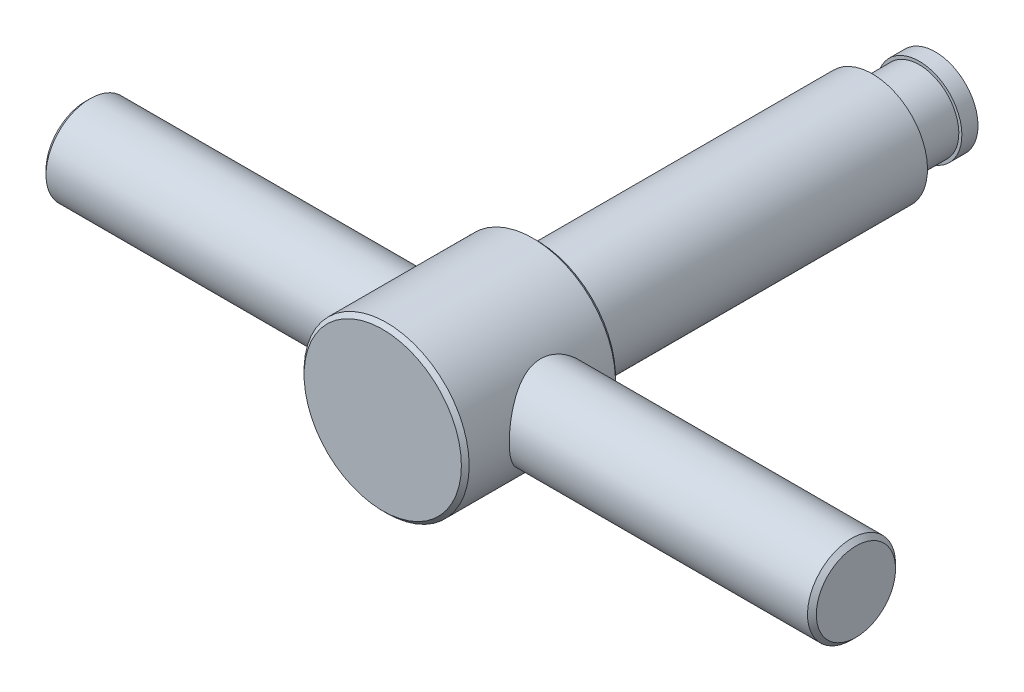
ISO-10303-21;
HEADER;
FILE_DESCRIPTION(('STEP AP214'),'2;1');
FILE_NAME('part.step','',(''),(''),'','','');
FILE_SCHEMA(('AUTOMOTIVE_DESIGN { 1 0 10303 214 1 1 1 1 }'));
ENDSEC;
DATA;
#1=APPLICATION_CONTEXT('core data for automotive mechanical design processes');
#2=APPLICATION_PROTOCOL_DEFINITION('international standard','automotive_design',2000,#1);
#3=PRODUCT_CONTEXT('',#1,'mechanical');
#4=PRODUCT('Part','Part','',(#3));
#5=PRODUCT_RELATED_PRODUCT_CATEGORY('part','',(#4));
#6=PRODUCT_DEFINITION_FORMATION('','',#4);
#7=PRODUCT_DEFINITION_CONTEXT('part definition',#1,'design');
#8=PRODUCT_DEFINITION('design','',#6,#7);
#9=PRODUCT_DEFINITION_SHAPE('','',#8);
#10=(LENGTH_UNIT() NAMED_UNIT(*) SI_UNIT(.MILLI.,.METRE.));
#11=(NAMED_UNIT(*) PLANE_ANGLE_UNIT() SI_UNIT($,.RADIAN.));
#12=(NAMED_UNIT(*) SI_UNIT($,.STERADIAN.) SOLID_ANGLE_UNIT());
#13=UNCERTAINTY_MEASURE_WITH_UNIT(LENGTH_MEASURE(1.E-05),#10,'distance_accuracy_value','');
#14=(GEOMETRIC_REPRESENTATION_CONTEXT(3) GLOBAL_UNCERTAINTY_ASSIGNED_CONTEXT((#13)) GLOBAL_UNIT_ASSIGNED_CONTEXT((#10,
#11,#12)) REPRESENTATION_CONTEXT('',''));
#15=CARTESIAN_POINT('',(0.,0.,0.));
#16=DIRECTION('',(0.,0.,1.));
#17=DIRECTION('',(1.,0.,0.));
#18=AXIS2_PLACEMENT_3D('',#15,#16,#17);
#19=CARTESIAN_POINT('',(70.,0.,94.2));
#20=DIRECTION('',(-1.,0.,0.));
#21=DIRECTION('',(0.,-1.,0.));
#22=AXIS2_PLACEMENT_3D('',#19,#20,#21);
#23=PLANE('',#22);
#24=CARTESIAN_POINT('',(70.,0.,87.));
#25=DIRECTION('',(-1.,0.,0.));
#26=DIRECTION('',(0.,-1.,0.));
#27=AXIS2_PLACEMENT_3D('',#24,#25,#26);
#28=CIRCLE('',#27,7.2);
#29=CARTESIAN_POINT('',(70.,-7.2,87.));
#30=VERTEX_POINT('',#29);
#31=EDGE_CURVE('E15',#30,#30,#28,.T.);
#32=ORIENTED_EDGE('',*,*,#31,.F.);
#33=EDGE_LOOP('',(#32));
#34=FACE_BOUND('',#33,.T.);
#35=ADVANCED_FACE('F12',(#34),#23,.F.);
#36=CARTESIAN_POINT('',(-70.,0.,87.));
#37=DIRECTION('',(1.,0.,0.));
#38=DIRECTION('',(0.,1.,0.));
#39=AXIS2_PLACEMENT_3D('',#36,#37,#38);
#40=PLANE('',#39);
#41=CARTESIAN_POINT('',(-70.,0.,87.));
#42=DIRECTION('',(1.,0.,0.));
#43=DIRECTION('',(0.,1.,0.));
#44=AXIS2_PLACEMENT_3D('',#41,#42,#43);
#45=CIRCLE('',#44,7.2);
#46=CARTESIAN_POINT('',(-70.,7.2,87.));
#47=VERTEX_POINT('',#46);
#48=EDGE_CURVE('E133',#47,#47,#45,.T.);
#49=ORIENTED_EDGE('',*,*,#48,.F.);
#50=EDGE_LOOP('',(#49));
#51=FACE_BOUND('',#50,.T.);
#52=ADVANCED_FACE('F171',(#51),#40,.F.);
#53=CARTESIAN_POINT('',(0.,0.,13.));
#54=DIRECTION('',(-1.,0.,0.));
#55=DIRECTION('',(0.,1.,0.));
#56=AXIS2_PLACEMENT_3D('',#53,#54,#55);
#57=SPHERICAL_SURFACE('',#56,13.);
#58=CARTESIAN_POINT('',(0.,0.,2.56268712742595));
#59=DIRECTION('',(0.,0.,1.));
#60=DIRECTION('',(0.,-1.,0.));
#61=AXIS2_PLACEMENT_3D('',#58,#59,#60);
#62=CIRCLE('',#61,7.75);
#63=CARTESIAN_POINT('',(0.,-7.75,2.56268712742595));
#64=VERTEX_POINT('',#63);
#65=EDGE_CURVE('E126',#64,#64,#62,.T.);
#66=ORIENTED_EDGE('',*,*,#65,.F.);
#67=EDGE_LOOP('',(#66));
#68=FACE_BOUND('',#67,.T.);
#69=ADVANCED_FACE('F168',(#68),#57,.T.);
#70=CARTESIAN_POINT('',(69.2,0.,87.));
#71=DIRECTION('',(-1.,0.,0.));
#72=DIRECTION('',(0.,-1.,0.));
#73=AXIS2_PLACEMENT_3D('',#70,#71,#72);
#74=CONICAL_SURFACE('',#73,8.,0.785398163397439);
#75=CARTESIAN_POINT('',(69.2,0.,87.));
#76=DIRECTION('',(-1.,0.,0.));
#77=DIRECTION('',(0.,-1.,0.));
#78=AXIS2_PLACEMENT_3D('',#75,#76,#77);
#79=CIRCLE('',#78,8.);
#80=CARTESIAN_POINT('',(69.2,-8.,87.));
#81=VERTEX_POINT('',#80);
#82=EDGE_CURVE('E124',#81,#81,#79,.T.);
#83=ORIENTED_EDGE('',*,*,#82,.F.);
#84=EDGE_LOOP('',(#83));
#85=FACE_BOUND('',#84,.T.);
#86=ORIENTED_EDGE('',*,*,#31,.T.);
#87=EDGE_LOOP('',(#86));
#88=FACE_BOUND('',#87,.T.);
#89=ADVANCED_FACE('F164',(#85,#88),#74,.T.);
#90=CARTESIAN_POINT('',(0.,0.,103.));
#91=DIRECTION('',(0.,0.,-1.));
#92=DIRECTION('',(0.,1.,0.));
#93=AXIS2_PLACEMENT_3D('',#90,#91,#92);
#94=PLANE('',#93);
#95=CARTESIAN_POINT('',(0.,0.,103.));
#96=DIRECTION('',(0.,0.,-1.));
#97=DIRECTION('',(1.,0.,0.));
#98=AXIS2_PLACEMENT_3D('',#95,#96,#97);
#99=CIRCLE('',#98,14.2928932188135);
#100=CARTESIAN_POINT('',(14.2928932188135,0.,103.));
#101=VERTEX_POINT('',#100);
#102=EDGE_CURVE('E121',#101,#101,#99,.T.);
#103=ORIENTED_EDGE('',*,*,#102,.F.);
#104=EDGE_LOOP('',(#103));
#105=FACE_BOUND('',#104,.T.);
#106=ADVANCED_FACE('F160',(#105),#94,.F.);
#107=CARTESIAN_POINT('',(-69.2,0.,87.));
#108=DIRECTION('',(1.,0.,0.));
#109=DIRECTION('',(0.,1.,0.));
#110=AXIS2_PLACEMENT_3D('',#107,#108,#109);
#111=CONICAL_SURFACE('',#110,8.,0.785398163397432);
#112=ORIENTED_EDGE('',*,*,#48,.T.);
#113=EDGE_LOOP('',(#112));
#114=FACE_BOUND('',#113,.T.);
#115=CARTESIAN_POINT('',(-69.2,0.,87.));
#116=DIRECTION('',(-1.,0.,0.));
#117=DIRECTION('',(0.,-1.,0.));
#118=AXIS2_PLACEMENT_3D('',#115,#116,#117);
#119=CIRCLE('',#118,8.);
#120=CARTESIAN_POINT('',(-69.2,-8.,87.));
#121=VERTEX_POINT('',#120);
#122=EDGE_CURVE('E117',#121,#121,#119,.F.);
#123=ORIENTED_EDGE('',*,*,#122,.F.);
#124=EDGE_LOOP('',(#123));
#125=FACE_BOUND('',#124,.T.);
#126=ADVANCED_FACE('F154',(#114,#125),#111,.T.);
#127=CARTESIAN_POINT('',(0.,0.,0.));
#128=DIRECTION('',(0.,0.,1.));
#129=DIRECTION('',(0.,-1.,0.));
#130=AXIS2_PLACEMENT_3D('',#127,#128,#129);
#131=CYLINDRICAL_SURFACE('',#130,7.75);
#132=CARTESIAN_POINT('',(0.,0.,5.5));
#133=DIRECTION('',(0.,0.,1.));
#134=DIRECTION('',(0.,-1.,0.));
#135=AXIS2_PLACEMENT_3D('',#132,#133,#134);
#136=CIRCLE('',#135,7.75);
#137=CARTESIAN_POINT('',(0.,-7.75,5.5));
#138=VERTEX_POINT('',#137);
#139=EDGE_CURVE('E120',#138,#138,#136,.F.);
#140=ORIENTED_EDGE('',*,*,#139,.T.);
#141=EDGE_LOOP('',(#140));
#142=FACE_BOUND('',#141,.T.);
#143=ORIENTED_EDGE('',*,*,#65,.T.);
#144=EDGE_LOOP('',(#143));
#145=FACE_BOUND('',#144,.T.);
#146=ADVANCED_FACE('F147',(#142,#145),#131,.T.);
#147=CARTESIAN_POINT('',(70.,0.,87.));
#148=DIRECTION('',(-1.,0.,0.));
#149=DIRECTION('',(0.,-1.,0.));
#150=AXIS2_PLACEMENT_3D('',#147,#148,#149);
#151=CYLINDRICAL_SURFACE('',#150,8.);
#152=CARTESIAN_POINT('',(12.689294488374,7.99886275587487,86.8651125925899));
#153=CARTESIAN_POINT('',(12.6915005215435,7.99536276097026,86.6575351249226));
#154=CARTESIAN_POINT('',(12.698815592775,7.9837723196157,86.4501531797));
#155=CARTESIAN_POINT('',(12.7233681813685,7.9445851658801,86.037422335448));
#156=CARTESIAN_POINT('',(12.7406097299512,7.91698195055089,85.8320742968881));
#157=CARTESIAN_POINT('',(12.7843716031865,7.8461182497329,85.4248121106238));
#158=CARTESIAN_POINT('',(12.8109052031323,7.80283536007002,85.2229033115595));
#159=CARTESIAN_POINT('',(12.8722778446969,7.70116762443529,84.8241368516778));
#160=CARTESIAN_POINT('',(12.9071206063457,7.64277601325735,84.6272814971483));
#161=CARTESIAN_POINT('',(12.9836650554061,7.51199941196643,84.2411706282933));
#162=CARTESIAN_POINT('',(13.0253198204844,7.43970959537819,84.0518734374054));
#163=CARTESIAN_POINT('',(13.1143932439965,7.2815471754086,83.6803838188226));
#164=CARTESIAN_POINT('',(13.1618139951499,7.19566963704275,83.498194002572));
#165=CARTESIAN_POINT('',(13.2610944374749,7.01101575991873,83.1417727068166));
#166=CARTESIAN_POINT('',(13.3129533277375,6.91224174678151,82.9675398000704));
#167=CARTESIAN_POINT('',(13.4197993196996,6.70245383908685,82.6276958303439));
#168=CARTESIAN_POINT('',(13.4747865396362,6.59143948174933,82.4620850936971));
#169=CARTESIAN_POINT('',(13.6534578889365,6.21800819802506,81.9475959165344));
#170=CARTESIAN_POINT('',(13.7808278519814,5.93298555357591,81.6158151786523));
#171=CARTESIAN_POINT('',(13.9689823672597,5.46769874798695,81.1560269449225));
#172=CARTESIAN_POINT('',(14.0312550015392,5.30619866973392,81.008998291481));
#173=CARTESIAN_POINT('',(14.1534426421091,4.9710976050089,80.7281643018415));
#174=CARTESIAN_POINT('',(14.213357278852,4.79749473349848,80.5943610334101));
#175=CARTESIAN_POINT('',(14.3333751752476,4.4266170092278,80.3321545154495));
#176=CARTESIAN_POINT('',(14.3932045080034,4.22853538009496,80.2047658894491));
#177=CARTESIAN_POINT('',(14.5067990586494,3.82067538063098,79.9673562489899));
#178=CARTESIAN_POINT('',(14.5605669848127,3.61090229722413,79.8573274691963));
#179=CARTESIAN_POINT('',(14.6604907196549,3.18098894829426,79.6557745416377));
#180=CARTESIAN_POINT('',(14.706649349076,2.96085256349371,79.5642435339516));
#181=CARTESIAN_POINT('',(14.789966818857,2.51177337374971,79.4007850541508));
#182=CARTESIAN_POINT('',(14.8271268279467,2.28283171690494,79.3288550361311));
#183=CARTESIAN_POINT('',(14.8884993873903,1.83808610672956,79.2109230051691));
#184=CARTESIAN_POINT('',(14.9135510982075,1.62284762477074,79.1632221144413));
#185=CARTESIAN_POINT('',(14.9544481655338,1.18831227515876,79.0856706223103));
#186=CARTESIAN_POINT('',(14.9702940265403,0.969015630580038,79.0558190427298));
#187=CARTESIAN_POINT('',(14.9923149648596,0.528336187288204,79.0143994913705));
#188=CARTESIAN_POINT('',(14.9984951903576,0.306954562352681,79.0028217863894));
#189=CARTESIAN_POINT('',(15.0010180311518,-0.136055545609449,78.9980909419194));
#190=CARTESIAN_POINT('',(14.9973612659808,-0.357684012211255,79.0049366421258));
#191=CARTESIAN_POINT('',(14.981126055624,-0.778417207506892,79.0354359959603));
#192=CARTESIAN_POINT('',(14.9694202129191,-0.977677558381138,79.0574460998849));
#193=CARTESIAN_POINT('',(14.9383067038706,-1.37346486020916,79.116242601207));
#194=CARTESIAN_POINT('',(14.9188964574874,-1.56999087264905,79.1530339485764));
#195=CARTESIAN_POINT('',(14.8728340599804,-1.95886060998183,79.2409669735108));
#196=CARTESIAN_POINT('',(14.8461843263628,-2.15120570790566,79.2921038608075));
#197=CARTESIAN_POINT('',(14.7862300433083,-2.53067624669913,79.4082235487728));
#198=CARTESIAN_POINT('',(14.7529229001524,-2.71779962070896,79.473211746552));
#199=CARTESIAN_POINT('',(14.6796612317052,-3.0893515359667,79.6178308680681));
#200=CARTESIAN_POINT('',(14.6395886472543,-3.27365430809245,79.6977251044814));
#201=CARTESIAN_POINT('',(14.5541371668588,-3.6347733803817,79.8705866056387));
#202=CARTESIAN_POINT('',(14.5087564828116,-3.81158713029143,79.963558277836));
#203=CARTESIAN_POINT('',(14.3660522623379,-4.32949358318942,80.261018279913));
#204=CARTESIAN_POINT('',(14.2621230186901,-4.65826391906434,80.4841350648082));
#205=CARTESIAN_POINT('',(14.033251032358,-5.31033875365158,81.0007245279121));
#206=CARTESIAN_POINT('',(13.9072489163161,-5.62934769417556,81.2991547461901));
#207=CARTESIAN_POINT('',(13.7186181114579,-6.06836546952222,81.7824852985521));
#208=CARTESIAN_POINT('',(13.6557521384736,-6.20821998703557,81.9496939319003));
#209=CARTESIAN_POINT('',(13.5316987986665,-6.47415011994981,82.2954360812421));
#210=CARTESIAN_POINT('',(13.4705117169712,-6.600223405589,82.4739715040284));
#211=CARTESIAN_POINT('',(13.347181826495,-6.84638984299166,82.8548783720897));
#212=CARTESIAN_POINT('',(13.2852906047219,-6.965389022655,83.058039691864));
#213=CARTESIAN_POINT('',(13.1675025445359,-7.18557329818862,83.4753502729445));
#214=CARTESIAN_POINT('',(13.1116028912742,-7.28676677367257,83.6894943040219));
#215=CARTESIAN_POINT('',(13.0079356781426,-7.47025544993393,84.1274405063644));
#216=CARTESIAN_POINT('',(12.9601615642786,-7.55256590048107,84.3512347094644));
#217=CARTESIAN_POINT('',(12.8747418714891,-7.69727883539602,84.8070470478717));
#218=CARTESIAN_POINT('',(12.8370945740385,-7.75968469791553,85.0390637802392));
#219=CARTESIAN_POINT('',(12.7766247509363,-7.85881118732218,85.4877426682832));
#220=CARTESIAN_POINT('',(12.752758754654,-7.89736348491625,85.7038597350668));
#221=CARTESIAN_POINT('',(12.715875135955,-7.9566167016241,86.1394501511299));
#222=CARTESIAN_POINT('',(12.7028567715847,-7.97731884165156,86.3589232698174));
#223=CARTESIAN_POINT('',(12.6882634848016,-8.00050992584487,86.7990625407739));
#224=CARTESIAN_POINT('',(12.6866808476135,-8.00301114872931,87.0197277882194));
#225=CARTESIAN_POINT('',(12.6950135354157,-7.9897869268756,87.4602823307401));
#226=CARTESIAN_POINT('',(12.7049279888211,-7.97406286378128,87.6801716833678));
#227=CARTESIAN_POINT('',(12.7338390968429,-7.92779706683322,88.0894661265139));
#228=CARTESIAN_POINT('',(12.7515286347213,-7.89938068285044,88.2792096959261));
#229=CARTESIAN_POINT('',(12.7947377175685,-7.82920080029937,88.655364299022));
#230=CARTESIAN_POINT('',(12.8202598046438,-7.78743296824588,88.8417742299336));
#231=CARTESIAN_POINT('',(12.8783315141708,-7.69101670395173,89.2100890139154));
#232=CARTESIAN_POINT('',(12.9108805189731,-7.63636940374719,89.3919942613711));
#233=CARTESIAN_POINT('',(12.9820636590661,-7.51471774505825,89.7504330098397));
#234=CARTESIAN_POINT('',(13.0207002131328,-7.44770847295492,89.9269643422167));
#235=CARTESIAN_POINT('',(13.1488722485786,-7.22069987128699,90.4668975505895));
#236=CARTESIAN_POINT('',(13.2472287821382,-7.04015992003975,90.819794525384));
#237=CARTESIAN_POINT('',(13.4565981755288,-6.63118330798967,91.4925080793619));
#238=CARTESIAN_POINT('',(13.5676179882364,-6.4027202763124,91.812306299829));
#239=CARTESIAN_POINT('',(13.7446246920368,-6.009168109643,92.285855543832));
#240=CARTESIAN_POINT('',(13.8096255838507,-5.85860208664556,92.4522584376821));
#241=CARTESIAN_POINT('',(13.9389400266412,-5.54390231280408,92.7719517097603));
#242=CARTESIAN_POINT('',(14.0032537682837,-5.37977244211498,92.9252458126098));
#243=CARTESIAN_POINT('',(14.1296197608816,-5.03854925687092,93.2180063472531));
#244=CARTESIAN_POINT('',(14.1916701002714,-4.86144534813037,93.3574612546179));
#245=CARTESIAN_POINT('',(14.3118643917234,-4.49529134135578,93.6214246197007));
#246=CARTESIAN_POINT('',(14.3700100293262,-4.30624646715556,93.7459395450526));
#247=CARTESIAN_POINT('',(14.4826332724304,-3.91111396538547,93.9826814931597));
#248=CARTESIAN_POINT('',(14.5369434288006,-3.70468126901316,94.0944138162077));
#249=CARTESIAN_POINT('',(14.6383180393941,-3.28131316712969,94.2998865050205));
#250=CARTESIAN_POINT('',(14.6853822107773,-3.06437735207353,94.3936261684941));
#251=CARTESIAN_POINT('',(14.7708257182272,-2.62172979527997,94.5619141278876));
#252=CARTESIAN_POINT('',(14.8092123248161,-2.39602558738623,94.6364784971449));
#253=CARTESIAN_POINT('',(14.8761439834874,-1.93752040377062,94.7654817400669));
#254=CARTESIAN_POINT('',(14.904690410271,-1.70472042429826,94.8199234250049));
#255=CARTESIAN_POINT('',(14.9486186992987,-1.25847496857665,94.9033103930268));
#256=CARTESIAN_POINT('',(14.9650560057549,-1.04551498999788,94.934308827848));
#257=CARTESIAN_POINT('',(14.9888266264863,-0.617288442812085,94.9790530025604));
#258=CARTESIAN_POINT('',(14.9961605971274,-0.402022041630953,94.9927999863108));
#259=CARTESIAN_POINT('',(15.0015197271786,0.0289601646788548,95.002850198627));
#260=CARTESIAN_POINT('',(14.9995479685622,0.244675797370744,94.9991592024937));
#261=CARTESIAN_POINT('',(14.986357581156,0.674817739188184,94.9743980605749));
#262=CARTESIAN_POINT('',(14.9751392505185,0.889244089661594,94.9533284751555));
#263=CARTESIAN_POINT('',(14.9449461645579,1.29907532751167,94.8963250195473));
#264=CARTESIAN_POINT('',(14.9266159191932,1.49470112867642,94.8616238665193));
#265=CARTESIAN_POINT('',(14.8827292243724,1.88212313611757,94.7779751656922));
#266=CARTESIAN_POINT('',(14.8571703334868,2.07391802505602,94.7290228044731));
#267=CARTESIAN_POINT('',(14.7994088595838,2.4523730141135,94.6173998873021));
#268=CARTESIAN_POINT('',(14.7672082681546,2.63903463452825,94.5547334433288));
#269=CARTESIAN_POINT('',(14.6968369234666,3.00632106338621,94.4162371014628));
#270=CARTESIAN_POINT('',(14.6586638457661,3.18694348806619,94.340402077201));
#271=CARTESIAN_POINT('',(14.5753142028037,3.54912314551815,94.1725398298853));
#272=CARTESIAN_POINT('',(14.5299005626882,3.73036002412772,94.0799395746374));
#273=CARTESIAN_POINT('',(14.4343837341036,4.08438470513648,93.8817854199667));
#274=CARTESIAN_POINT('',(14.3842789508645,4.25716960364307,93.7762271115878));
#275=CARTESIAN_POINT('',(14.2804213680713,4.59353407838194,93.5528780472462));
#276=CARTESIAN_POINT('',(14.2266678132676,4.75711173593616,93.4350847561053));
#277=CARTESIAN_POINT('',(14.1166098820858,5.07439931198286,93.187965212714));
#278=CARTESIAN_POINT('',(14.0603053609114,5.22810866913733,93.0586383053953));
#279=CARTESIAN_POINT('',(13.9399234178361,5.54164068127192,92.7740704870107));
#280=CARTESIAN_POINT('',(13.8756786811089,5.70023771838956,92.6175476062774));
#281=CARTESIAN_POINT('',(13.7470505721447,6.00381408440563,92.291859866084));
#282=CARTESIAN_POINT('',(13.6826671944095,6.14879286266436,92.1226944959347));
#283=CARTESIAN_POINT('',(13.5553846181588,6.42453340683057,91.7723278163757));
#284=CARTESIAN_POINT('',(13.4924869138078,6.55528130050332,91.5911150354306));
#285=CARTESIAN_POINT('',(13.3699927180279,6.8016340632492,91.2175631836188));
#286=CARTESIAN_POINT('',(13.3103967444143,6.9172365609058,91.0252223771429));
#287=CARTESIAN_POINT('',(13.1937787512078,7.13725424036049,90.6214363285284));
#288=CARTESIAN_POINT('',(13.1369921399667,7.24093489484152,90.409521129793));
#289=CARTESIAN_POINT('',(13.0311666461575,7.42969787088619,89.9758163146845));
#290=CARTESIAN_POINT('',(12.9821236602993,7.51479005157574,89.7540320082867));
#291=CARTESIAN_POINT('',(12.8939118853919,7.66515673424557,89.3025692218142));
#292=CARTESIAN_POINT('',(12.8547179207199,7.73048185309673,89.0729126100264));
#293=CARTESIAN_POINT('',(12.787887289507,7.8405424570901,88.6071963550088));
#294=CARTESIAN_POINT('',(12.760242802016,7.88529187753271,88.3711411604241));
#295=CARTESIAN_POINT('',(12.7204492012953,7.949301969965,87.9237412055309));
#296=CARTESIAN_POINT('',(12.7068270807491,7.97099628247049,87.7128729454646));
#297=CARTESIAN_POINT('',(12.6901221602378,7.99756562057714,87.2896392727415));
#298=CARTESIAN_POINT('',(12.6870397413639,8.00244003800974,87.0772738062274));
#299=CARTESIAN_POINT('',(12.689294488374,7.99886275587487,86.8651125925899));
#300=B_SPLINE_CURVE_WITH_KNOTS('',3,(#152,#153,#154,#155,#156,#157,#158,#159,#160,#161,#162,
#163,#164,#165,#166,#167,#168,#169,#170,#171,#172,#173,#174,#175,#176,#177,#178,#179,#180,#181,
#182,#183,#184,#185,#186,#187,#188,#189,#190,#191,#192,#193,#194,#195,#196,#197,#198,#199,#200,
#201,#202,#203,#204,#205,#206,#207,#208,#209,#210,#211,#212,#213,#214,#215,#216,#217,#218,#219,
#220,#221,#222,#223,#224,#225,#226,#227,#228,#229,#230,#231,#232,#233,#234,#235,#236,#237,#238,
#239,#240,#241,#242,#243,#244,#245,#246,#247,#248,#249,#250,#251,#252,#253,#254,#255,#256,#257,
#258,#259,#260,#261,#262,#263,#264,#265,#266,#267,#268,#269,#270,#271,#272,#273,#274,#275,#276,
#277,#278,#279,#280,#281,#282,#283,#284,#285,#286,#287,#288,#289,#290,#291,#292,#293,#294,#295,
#296,#297,#298,#299),.UNSPECIFIED.,.T.,.F.,(4,2,2,2,2,2,2,2,2,2,2,2,2,2,2,2,2,2,2,2,2,2,2,2,2,2,
2,2,2,2,2,2,2,2,2,2,2,2,2,2,2,2,2,2,2,2,2,2,2,2,2,2,2,2,2,2,2,2,2,2,2,2,2,2,2,2,2,2,2,2,2,2,2,
4),(0.,0.622631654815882,1.24551634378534,1.86929458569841,2.49335262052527,3.1132803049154,
3.73343366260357,4.35347534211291,4.97354047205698,6.33343330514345,7.01422801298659,
7.6951289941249,8.42315420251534,9.15085282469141,9.87828108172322,10.6056148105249,
11.2703407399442,11.9350302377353,12.5993655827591,13.2636590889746,13.8653947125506,
14.4673320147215,15.0690685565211,15.6710399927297,16.2848738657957,16.8989151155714,
18.1263080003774,19.4841652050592,20.1642035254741,20.8443566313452,21.5737574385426,
22.3028140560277,23.031279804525,23.7596218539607,24.4211187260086,25.0825703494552,
25.7435757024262,26.4045309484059,26.9819001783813,27.5594569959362,28.1369630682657,
28.7146991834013,29.9349233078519,31.1558206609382,31.8560597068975,32.5560991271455,
33.2567166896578,33.9570298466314,34.6788463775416,35.4006910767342,36.121928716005,
36.8430655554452,37.4896930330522,38.1362738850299,38.7826406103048,39.4289864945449,
40.026878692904,40.6249730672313,41.2228883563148,41.8210369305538,42.4459714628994,
43.0711192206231,43.696396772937,44.3217098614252,45.016663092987,45.7116444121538,
46.4072972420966,47.1030588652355,47.8300331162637,48.5566208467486,49.281331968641,
50.0055515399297,50.6419091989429,51.2782898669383),.UNSPECIFIED.);
#301=CARTESIAN_POINT('',(12.689294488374,7.99886275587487,86.8651125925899));
#302=VERTEX_POINT('',#301);
#303=EDGE_CURVE('E46',#302,#302,#300,.T.);
#304=ORIENTED_EDGE('',*,*,#303,.F.);
#305=EDGE_LOOP('',(#304));
#306=FACE_BOUND('',#305,.T.);
#307=ORIENTED_EDGE('',*,*,#82,.T.);
#308=EDGE_LOOP('',(#307));
#309=FACE_BOUND('',#308,.T.);
#310=ADVANCED_FACE('F145',(#306,#309),#151,.T.);
#311=CARTESIAN_POINT('',(0.,0.,102.292893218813));
#312=DIRECTION('',(0.,0.,-1.));
#313=DIRECTION('',(1.,0.,0.));
#314=AXIS2_PLACEMENT_3D('',#311,#312,#313);
#315=CONICAL_SURFACE('',#314,15.0000000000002,0.785398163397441);
#316=ORIENTED_EDGE('',*,*,#102,.T.);
#317=EDGE_LOOP('',(#316));
#318=FACE_BOUND('',#317,.T.);
#319=CARTESIAN_POINT('',(0.,0.,102.292893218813));
#320=DIRECTION('',(0.,0.,1.));
#321=DIRECTION('',(0.,-1.,0.));
#322=AXIS2_PLACEMENT_3D('',#319,#320,#321);
#323=CIRCLE('',#322,15.);
#324=CARTESIAN_POINT('',(0.,-15.,102.292893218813));
#325=VERTEX_POINT('',#324);
#326=EDGE_CURVE('E45',#325,#325,#323,.F.);
#327=ORIENTED_EDGE('',*,*,#326,.F.);
#328=EDGE_LOOP('',(#327));
#329=FACE_BOUND('',#328,.T.);
#330=ADVANCED_FACE('F72',(#318,#329),#315,.T.);
#331=CARTESIAN_POINT('',(70.,0.,87.));
#332=DIRECTION('',(-1.,0.,0.));
#333=DIRECTION('',(0.,-1.,0.));
#334=AXIS2_PLACEMENT_3D('',#331,#332,#333);
#335=CYLINDRICAL_SURFACE('',#334,8.);
#336=ORIENTED_EDGE('',*,*,#122,.T.);
#337=EDGE_LOOP('',(#336));
#338=FACE_BOUND('',#337,.T.);
#339=CARTESIAN_POINT('',(-12.689294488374,7.99886275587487,87.13488740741));
#340=CARTESIAN_POINT('',(-12.6915005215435,7.99536276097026,87.3424648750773));
#341=CARTESIAN_POINT('',(-12.698815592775,7.98377231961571,87.5498468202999));
#342=CARTESIAN_POINT('',(-12.7233681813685,7.94458516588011,87.962577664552));
#343=CARTESIAN_POINT('',(-12.7406097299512,7.91698195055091,88.1679257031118));
#344=CARTESIAN_POINT('',(-12.7843716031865,7.84611824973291,88.5751878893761));
#345=CARTESIAN_POINT('',(-12.8109052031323,7.80283536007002,88.7770966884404));
#346=CARTESIAN_POINT('',(-12.8722778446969,7.7011676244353,89.1758631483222));
#347=CARTESIAN_POINT('',(-12.9071206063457,7.64277601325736,89.3727185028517));
#348=CARTESIAN_POINT('',(-12.9836650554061,7.51199941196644,89.7588293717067));
#349=CARTESIAN_POINT('',(-13.0253198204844,7.43970959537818,89.9481265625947));
#350=CARTESIAN_POINT('',(-13.1143932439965,7.28154717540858,90.3196161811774));
#351=CARTESIAN_POINT('',(-13.1618139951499,7.19566963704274,90.501805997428));
#352=CARTESIAN_POINT('',(-13.261094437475,7.01101575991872,90.8582272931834));
#353=CARTESIAN_POINT('',(-13.3129533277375,6.9122417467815,91.0324601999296));
#354=CARTESIAN_POINT('',(-13.4197993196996,6.70245383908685,91.3723041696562));
#355=CARTESIAN_POINT('',(-13.4747865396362,6.59143948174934,91.5379149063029));
#356=CARTESIAN_POINT('',(-13.6534578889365,6.21800819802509,92.0524040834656));
#357=CARTESIAN_POINT('',(-13.7808278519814,5.93298555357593,92.3841848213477));
#358=CARTESIAN_POINT('',(-13.9689823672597,5.46769874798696,92.8439730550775));
#359=CARTESIAN_POINT('',(-14.0312550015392,5.30619866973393,92.991001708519));
#360=CARTESIAN_POINT('',(-14.1534426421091,4.97109760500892,93.2718356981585));
#361=CARTESIAN_POINT('',(-14.213357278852,4.79749473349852,93.4056389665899));
#362=CARTESIAN_POINT('',(-14.3333751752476,4.42661700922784,93.6678454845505));
#363=CARTESIAN_POINT('',(-14.3932045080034,4.22853538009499,93.7952341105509));
#364=CARTESIAN_POINT('',(-14.5067990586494,3.820675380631,94.03264375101));
#365=CARTESIAN_POINT('',(-14.5605669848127,3.61090229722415,94.1426725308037));
#366=CARTESIAN_POINT('',(-14.6604907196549,3.18098894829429,94.3442254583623));
#367=CARTESIAN_POINT('',(-14.706649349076,2.96085256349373,94.4357564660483));
#368=CARTESIAN_POINT('',(-14.789966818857,2.51177337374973,94.5992149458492));
#369=CARTESIAN_POINT('',(-14.8271268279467,2.28283171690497,94.6711449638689));
#370=CARTESIAN_POINT('',(-14.8884993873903,1.83808610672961,94.7890769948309));
#371=CARTESIAN_POINT('',(-14.9135510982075,1.62284762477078,94.8367778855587));
#372=CARTESIAN_POINT('',(-14.9544481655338,1.18831227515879,94.9143293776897));
#373=CARTESIAN_POINT('',(-14.9702940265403,0.969015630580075,94.9441809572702));
#374=CARTESIAN_POINT('',(-14.9923149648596,0.528336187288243,94.9856005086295));
#375=CARTESIAN_POINT('',(-14.9984951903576,0.30695456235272,94.9971782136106));
#376=CARTESIAN_POINT('',(-15.0010180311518,-0.136055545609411,95.0019090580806));
#377=CARTESIAN_POINT('',(-14.9973612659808,-0.357684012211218,94.9950633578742));
#378=CARTESIAN_POINT('',(-14.981126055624,-0.778417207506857,94.9645640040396));
#379=CARTESIAN_POINT('',(-14.9694202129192,-0.977677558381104,94.9425539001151));
#380=CARTESIAN_POINT('',(-14.9383067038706,-1.37346486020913,94.8837573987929));
#381=CARTESIAN_POINT('',(-14.9188964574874,-1.56999087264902,94.8469660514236));
#382=CARTESIAN_POINT('',(-14.8728340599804,-1.9588606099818,94.7590330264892));
#383=CARTESIAN_POINT('',(-14.8461843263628,-2.15120570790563,94.7078961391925));
#384=CARTESIAN_POINT('',(-14.7862300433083,-2.5306762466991,94.5917764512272));
#385=CARTESIAN_POINT('',(-14.7529229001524,-2.71779962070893,94.5267882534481));
#386=CARTESIAN_POINT('',(-14.6796612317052,-3.08935153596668,94.3821691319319));
#387=CARTESIAN_POINT('',(-14.6395886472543,-3.27365430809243,94.3022748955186));
#388=CARTESIAN_POINT('',(-14.5541371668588,-3.63477338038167,94.1294133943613));
#389=CARTESIAN_POINT('',(-14.5087564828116,-3.81158713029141,94.036441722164));
#390=CARTESIAN_POINT('',(-14.3660522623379,-4.32949358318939,93.738981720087));
#391=CARTESIAN_POINT('',(-14.2621230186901,-4.65826391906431,93.5158649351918));
#392=CARTESIAN_POINT('',(-14.033251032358,-5.31033875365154,92.9992754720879));
#393=CARTESIAN_POINT('',(-13.9072489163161,-5.62934769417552,92.7008452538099));
#394=CARTESIAN_POINT('',(-13.718618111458,-6.06836546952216,92.2175147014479));
#395=CARTESIAN_POINT('',(-13.6557521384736,-6.2082199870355,92.0503060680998));
#396=CARTESIAN_POINT('',(-13.5316987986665,-6.47415011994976,91.704563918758));
#397=CARTESIAN_POINT('',(-13.4705117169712,-6.60022340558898,91.5260284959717));
#398=CARTESIAN_POINT('',(-13.347181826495,-6.84638984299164,91.1451216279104));
#399=CARTESIAN_POINT('',(-13.285290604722,-6.96538902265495,90.9419603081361));
#400=CARTESIAN_POINT('',(-13.1675025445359,-7.18557329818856,90.5246497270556));
#401=CARTESIAN_POINT('',(-13.1116028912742,-7.28676677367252,90.3105056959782));
#402=CARTESIAN_POINT('',(-13.0079356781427,-7.4702554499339,89.8725594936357));
#403=CARTESIAN_POINT('',(-12.9601615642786,-7.55256590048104,89.6487652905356));
#404=CARTESIAN_POINT('',(-12.8747418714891,-7.697278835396,89.1929529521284));
#405=CARTESIAN_POINT('',(-12.8370945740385,-7.75968469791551,88.9609362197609));
#406=CARTESIAN_POINT('',(-12.7766247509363,-7.85881118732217,88.5122573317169));
#407=CARTESIAN_POINT('',(-12.752758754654,-7.89736348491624,88.2961402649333));
#408=CARTESIAN_POINT('',(-12.715875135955,-7.95661670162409,87.8605498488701));
#409=CARTESIAN_POINT('',(-12.7028567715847,-7.97731884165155,87.6410767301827));
#410=CARTESIAN_POINT('',(-12.6882634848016,-8.00050992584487,87.2009374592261));
#411=CARTESIAN_POINT('',(-12.6866808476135,-8.00301114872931,86.9802722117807));
#412=CARTESIAN_POINT('',(-12.6950135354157,-7.9897869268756,86.53971766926));
#413=CARTESIAN_POINT('',(-12.7049279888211,-7.97406286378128,86.3198283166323));
#414=CARTESIAN_POINT('',(-12.7338390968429,-7.92779706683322,85.9105338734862));
#415=CARTESIAN_POINT('',(-12.7515286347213,-7.89938068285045,85.720790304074));
#416=CARTESIAN_POINT('',(-12.7947377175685,-7.8292008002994,85.3446357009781));
#417=CARTESIAN_POINT('',(-12.8202598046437,-7.78743296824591,85.1582257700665));
#418=CARTESIAN_POINT('',(-12.8783315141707,-7.69101670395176,84.7899109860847));
#419=CARTESIAN_POINT('',(-12.9108805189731,-7.63636940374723,84.6080057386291));
#420=CARTESIAN_POINT('',(-12.9820636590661,-7.51471774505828,84.2495669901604));
#421=CARTESIAN_POINT('',(-13.0207002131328,-7.44770847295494,84.0730356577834));
#422=CARTESIAN_POINT('',(-13.1488722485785,-7.220699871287,83.5331024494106));
#423=CARTESIAN_POINT('',(-13.2472287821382,-7.0401599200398,83.1802054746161));
#424=CARTESIAN_POINT('',(-13.4565981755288,-6.63118330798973,82.5074919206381));
#425=CARTESIAN_POINT('',(-13.5676179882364,-6.40272027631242,82.1876937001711));
#426=CARTESIAN_POINT('',(-13.7446246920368,-6.00916810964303,81.7141444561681));
#427=CARTESIAN_POINT('',(-13.8096255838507,-5.85860208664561,81.547741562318));
#428=CARTESIAN_POINT('',(-13.9389400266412,-5.54390231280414,81.2280482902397));
#429=CARTESIAN_POINT('',(-14.0032537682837,-5.37977244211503,81.0747541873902));
#430=CARTESIAN_POINT('',(-14.1296197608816,-5.03854925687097,80.781993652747));
#431=CARTESIAN_POINT('',(-14.1916701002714,-4.8614453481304,80.6425387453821));
#432=CARTESIAN_POINT('',(-14.3118643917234,-4.49529134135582,80.3785753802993));
#433=CARTESIAN_POINT('',(-14.3700100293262,-4.30624646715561,80.2540604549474));
#434=CARTESIAN_POINT('',(-14.4826332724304,-3.91111396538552,80.0173185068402));
#435=CARTESIAN_POINT('',(-14.5369434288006,-3.70468126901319,79.9055861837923));
#436=CARTESIAN_POINT('',(-14.6383180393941,-3.28131316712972,79.7001134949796));
#437=CARTESIAN_POINT('',(-14.6853822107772,-3.06437735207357,79.606373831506));
#438=CARTESIAN_POINT('',(-14.7708257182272,-2.62172979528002,79.4380858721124));
#439=CARTESIAN_POINT('',(-14.8092123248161,-2.3960255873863,79.3635215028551));
#440=CARTESIAN_POINT('',(-14.8761439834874,-1.93752040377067,79.2345182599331));
#441=CARTESIAN_POINT('',(-14.904690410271,-1.7047204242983,79.1800765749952));
#442=CARTESIAN_POINT('',(-14.9486186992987,-1.25847496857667,79.0966896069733));
#443=CARTESIAN_POINT('',(-14.9650560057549,-1.04551498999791,79.065691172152));
#444=CARTESIAN_POINT('',(-14.9888266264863,-0.617288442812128,79.0209469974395));
#445=CARTESIAN_POINT('',(-14.9961605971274,-0.402022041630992,79.0072000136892));
#446=CARTESIAN_POINT('',(-15.0015197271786,0.0289601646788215,78.997149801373));
#447=CARTESIAN_POINT('',(-14.9995479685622,0.244675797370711,79.0008407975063));
#448=CARTESIAN_POINT('',(-14.986357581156,0.674817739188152,79.0256019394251));
#449=CARTESIAN_POINT('',(-14.9751392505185,0.88924408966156,79.0466715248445));
#450=CARTESIAN_POINT('',(-14.9449461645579,1.29907532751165,79.1036749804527));
#451=CARTESIAN_POINT('',(-14.9266159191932,1.4947011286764,79.1383761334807));
#452=CARTESIAN_POINT('',(-14.8827292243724,1.88212313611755,79.2220248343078));
#453=CARTESIAN_POINT('',(-14.8571703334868,2.07391802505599,79.2709771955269));
#454=CARTESIAN_POINT('',(-14.7994088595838,2.45237301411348,79.3826001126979));
#455=CARTESIAN_POINT('',(-14.7672082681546,2.63903463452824,79.4452665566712));
#456=CARTESIAN_POINT('',(-14.6968369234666,3.00632106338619,79.5837628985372));
#457=CARTESIAN_POINT('',(-14.6586638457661,3.18694348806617,79.6595979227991));
#458=CARTESIAN_POINT('',(-14.5753142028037,3.54912314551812,79.8274601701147));
#459=CARTESIAN_POINT('',(-14.5299005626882,3.7303600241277,79.9200604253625));
#460=CARTESIAN_POINT('',(-14.4343837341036,4.08438470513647,80.1182145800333));
#461=CARTESIAN_POINT('',(-14.3842789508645,4.25716960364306,80.2237728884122));
#462=CARTESIAN_POINT('',(-14.2804213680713,4.59353407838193,80.4471219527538));
#463=CARTESIAN_POINT('',(-14.2266678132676,4.75711173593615,80.5649152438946));
#464=CARTESIAN_POINT('',(-14.1166098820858,5.07439931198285,80.812034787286));
#465=CARTESIAN_POINT('',(-14.0603053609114,5.22810866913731,80.9413616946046));
#466=CARTESIAN_POINT('',(-13.9399234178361,5.5416406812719,81.2259295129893));
#467=CARTESIAN_POINT('',(-13.8756786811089,5.70023771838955,81.3824523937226));
#468=CARTESIAN_POINT('',(-13.7470505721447,6.00381408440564,81.7081401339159));
#469=CARTESIAN_POINT('',(-13.6826671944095,6.14879286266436,81.8773055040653));
#470=CARTESIAN_POINT('',(-13.5553846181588,6.42453340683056,82.2276721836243));
#471=CARTESIAN_POINT('',(-13.4924869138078,6.55528130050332,82.4088849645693));
#472=CARTESIAN_POINT('',(-13.3699927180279,6.80163406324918,82.7824368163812));
#473=CARTESIAN_POINT('',(-13.3103967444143,6.91723656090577,82.9747776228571));
#474=CARTESIAN_POINT('',(-13.1937787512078,7.13725424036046,83.3785636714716));
#475=CARTESIAN_POINT('',(-13.1369921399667,7.24093489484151,83.590478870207));
#476=CARTESIAN_POINT('',(-13.0311666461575,7.4296978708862,84.0241836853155));
#477=CARTESIAN_POINT('',(-12.9821236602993,7.51479005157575,84.2459679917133));
#478=CARTESIAN_POINT('',(-12.8939118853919,7.66515673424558,84.6974307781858));
#479=CARTESIAN_POINT('',(-12.8547179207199,7.73048185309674,84.9270873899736));
#480=CARTESIAN_POINT('',(-12.787887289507,7.8405424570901,85.3928036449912));
#481=CARTESIAN_POINT('',(-12.7602428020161,7.8852918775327,85.6288588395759));
#482=CARTESIAN_POINT('',(-12.7204492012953,7.94930196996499,86.0762587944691));
#483=CARTESIAN_POINT('',(-12.7068270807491,7.97099628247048,86.2871270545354));
#484=CARTESIAN_POINT('',(-12.6901221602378,7.99756562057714,86.7103607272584));
#485=CARTESIAN_POINT('',(-12.6870397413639,8.00244003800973,86.9227261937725));
#486=CARTESIAN_POINT('',(-12.689294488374,7.99886275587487,87.13488740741));
#487=B_SPLINE_CURVE_WITH_KNOTS('',3,(#339,#340,#341,#342,#343,#344,#345,#346,#347,#348,#349,
#350,#351,#352,#353,#354,#355,#356,#357,#358,#359,#360,#361,#362,#363,#364,#365,#366,#367,#368,
#369,#370,#371,#372,#373,#374,#375,#376,#377,#378,#379,#380,#381,#382,#383,#384,#385,#386,#387,
#388,#389,#390,#391,#392,#393,#394,#395,#396,#397,#398,#399,#400,#401,#402,#403,#404,#405,#406,
#407,#408,#409,#410,#411,#412,#413,#414,#415,#416,#417,#418,#419,#420,#421,#422,#423,#424,#425,
#426,#427,#428,#429,#430,#431,#432,#433,#434,#435,#436,#437,#438,#439,#440,#441,#442,#443,#444,
#445,#446,#447,#448,#449,#450,#451,#452,#453,#454,#455,#456,#457,#458,#459,#460,#461,#462,#463,
#464,#465,#466,#467,#468,#469,#470,#471,#472,#473,#474,#475,#476,#477,#478,#479,#480,#481,#482,
#483,#484,#485,#486),.UNSPECIFIED.,.T.,.F.,(4,2,2,2,2,2,2,2,2,2,2,2,2,2,2,2,2,2,2,2,2,2,2,2,2,2,
2,2,2,2,2,2,2,2,2,2,2,2,2,2,2,2,2,2,2,2,2,2,2,2,2,2,2,2,2,2,2,2,2,2,2,2,2,2,2,2,2,2,2,2,2,2,2,
4),(0.,0.622631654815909,1.24551634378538,1.86929458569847,2.49335262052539,3.11328030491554,
3.73343366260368,4.35347534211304,4.97354047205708,6.33343330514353,7.01422801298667,
7.69512899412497,8.42315420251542,9.15085282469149,9.8782810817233,10.6056148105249,
11.2703407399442,11.9350302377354,12.5993655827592,13.2636590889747,13.8653947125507,
14.4673320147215,15.0690685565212,15.6710399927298,16.2848738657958,16.8989151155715,
18.1263080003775,19.4841652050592,20.1642035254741,20.8443566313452,21.5737574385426,
22.3028140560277,23.031279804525,23.7596218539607,24.4211187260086,25.0825703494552,
25.7435757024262,26.4045309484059,26.9819001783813,27.5594569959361,28.1369630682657,
28.7146991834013,29.9349233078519,31.1558206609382,31.8560597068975,32.5560991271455,
33.2567166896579,33.9570298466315,34.6788463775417,35.4006910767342,36.121928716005,
36.8430655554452,37.4896930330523,38.13627388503,38.7826406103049,39.428986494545,
40.026878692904,40.6249730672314,41.2228883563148,41.8210369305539,42.4459714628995,
43.0711192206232,43.6963967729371,44.3217098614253,45.0166630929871,45.7116444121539,
46.4072972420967,47.1030588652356,47.8300331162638,48.5566208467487,49.2813319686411,
50.0055515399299,50.6419091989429,51.2782898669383),.UNSPECIFIED.);
#488=CARTESIAN_POINT('',(-12.689294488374,7.99886275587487,87.13488740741));
#489=VERTEX_POINT('',#488);
#490=EDGE_CURVE('E37',#489,#489,#487,.T.);
#491=ORIENTED_EDGE('',*,*,#490,.F.);
#492=EDGE_LOOP('',(#491));
#493=FACE_BOUND('',#492,.T.);
#494=ADVANCED_FACE('F52',(#338,#493),#335,.T.);
#495=CARTESIAN_POINT('',(7.2,0.,5.5));
#496=DIRECTION('',(0.,0.,-1.));
#497=DIRECTION('',(0.,1.,0.));
#498=AXIS2_PLACEMENT_3D('',#495,#496,#497);
#499=PLANE('',#498);
#500=CARTESIAN_POINT('',(0.,0.,5.5));
#501=DIRECTION('',(0.,0.,1.));
#502=DIRECTION('',(0.,-1.,0.));
#503=AXIS2_PLACEMENT_3D('',#500,#501,#502);
#504=CIRCLE('',#503,7.2);
#505=CARTESIAN_POINT('',(0.,-7.2,5.5));
#506=VERTEX_POINT('',#505);
#507=EDGE_CURVE('E33',#506,#506,#504,.T.);
#508=ORIENTED_EDGE('',*,*,#507,.F.);
#509=EDGE_LOOP('',(#508));
#510=FACE_BOUND('',#509,.T.);
#511=ORIENTED_EDGE('',*,*,#139,.F.);
#512=EDGE_LOOP('',(#511));
#513=FACE_BOUND('',#512,.T.);
#514=ADVANCED_FACE('F61',(#510,#513),#499,.F.);
#515=CARTESIAN_POINT('',(0.,0.,0.));
#516=DIRECTION('',(0.,0.,1.));
#517=DIRECTION('',(0.,-1.,0.));
#518=AXIS2_PLACEMENT_3D('',#515,#516,#517);
#519=CYLINDRICAL_SURFACE('',#518,15.);
#520=ORIENTED_EDGE('',*,*,#490,.T.);
#521=EDGE_LOOP('',(#520));
#522=FACE_BOUND('',#521,.T.);
#523=ORIENTED_EDGE('',*,*,#326,.T.);
#524=EDGE_LOOP('',(#523));
#525=FACE_BOUND('',#524,.T.);
#526=ORIENTED_EDGE('',*,*,#303,.T.);
#527=EDGE_LOOP('',(#526));
#528=FACE_BOUND('',#527,.T.);
#529=CARTESIAN_POINT('',(0.,0.,75.7071067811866));
#530=DIRECTION('',(0.,0.,1.));
#531=DIRECTION('',(0.,-1.,0.));
#532=AXIS2_PLACEMENT_3D('',#529,#530,#531);
#533=CIRCLE('',#532,15.);
#534=CARTESIAN_POINT('',(0.,-15.,75.7071067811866));
#535=VERTEX_POINT('',#534);
#536=EDGE_CURVE('E36',#535,#535,#533,.F.);
#537=ORIENTED_EDGE('',*,*,#536,.F.);
#538=EDGE_LOOP('',(#537));
#539=FACE_BOUND('',#538,.T.);
#540=ADVANCED_FACE('F56',(#522,#525,#528,#539),#519,.T.);
#541=CARTESIAN_POINT('',(0.,0.,0.));
#542=DIRECTION('',(0.,0.,1.));
#543=DIRECTION('',(0.,-1.,0.));
#544=AXIS2_PLACEMENT_3D('',#541,#542,#543);
#545=CYLINDRICAL_SURFACE('',#544,7.2);
#546=CARTESIAN_POINT('',(0.,0.,12.383419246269));
#547=DIRECTION('',(0.,0.,1.));
#548=DIRECTION('',(0.,-1.,0.));
#549=AXIS2_PLACEMENT_3D('',#546,#547,#548);
#550=CIRCLE('',#549,7.2);
#551=CARTESIAN_POINT('',(0.,-7.2,12.383419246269));
#552=VERTEX_POINT('',#551);
#553=EDGE_CURVE('E32',#552,#552,#550,.T.);
#554=ORIENTED_EDGE('',*,*,#553,.F.);
#555=EDGE_LOOP('',(#554));
#556=FACE_BOUND('',#555,.T.);
#557=ORIENTED_EDGE('',*,*,#507,.T.);
#558=EDGE_LOOP('',(#557));
#559=FACE_BOUND('',#558,.T.);
#560=ADVANCED_FACE('F60',(#556,#559),#545,.T.);
#561=CARTESIAN_POINT('',(0.,0.,75.7071067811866));
#562=DIRECTION('',(0.,0.,1.));
#563=DIRECTION('',(-1.,0.,0.));
#564=AXIS2_PLACEMENT_3D('',#561,#562,#563);
#565=CONICAL_SURFACE('',#564,15.,0.78539816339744);
#566=ORIENTED_EDGE('',*,*,#536,.T.);
#567=EDGE_LOOP('',(#566));
#568=FACE_BOUND('',#567,.T.);
#569=CARTESIAN_POINT('',(0.,0.,75.));
#570=DIRECTION('',(0.,0.,1.));
#571=DIRECTION('',(-1.,0.,0.));
#572=AXIS2_PLACEMENT_3D('',#569,#570,#571);
#573=CIRCLE('',#572,14.2928932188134);
#574=CARTESIAN_POINT('',(-14.2928932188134,0.,75.));
#575=VERTEX_POINT('',#574);
#576=EDGE_CURVE('E24',#575,#575,#573,.T.);
#577=ORIENTED_EDGE('',*,*,#576,.T.);
#578=EDGE_LOOP('',(#577));
#579=FACE_BOUND('',#578,.T.);
#580=ADVANCED_FACE('F90',(#568,#579),#565,.T.);
#581=CARTESIAN_POINT('',(0.,0.,14.));
#582=DIRECTION('',(0.,0.,1.));
#583=DIRECTION('',(-1.,0.,0.));
#584=AXIS2_PLACEMENT_3D('',#581,#582,#583);
#585=CONICAL_SURFACE('',#584,10.,1.0471975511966);
#586=CARTESIAN_POINT('',(0.,0.,14.));
#587=DIRECTION('',(0.,0.,1.));
#588=DIRECTION('',(0.,-1.,0.));
#589=AXIS2_PLACEMENT_3D('',#586,#587,#588);
#590=CIRCLE('',#589,10.);
#591=CARTESIAN_POINT('',(0.,-10.,14.));
#592=VERTEX_POINT('',#591);
#593=EDGE_CURVE('E19',#592,#592,#590,.T.);
#594=ORIENTED_EDGE('',*,*,#593,.F.);
#595=EDGE_LOOP('',(#594));
#596=FACE_BOUND('',#595,.T.);
#597=ORIENTED_EDGE('',*,*,#553,.T.);
#598=EDGE_LOOP('',(#597));
#599=FACE_BOUND('',#598,.T.);
#600=ADVANCED_FACE('F84',(#596,#599),#585,.T.);
#601=CARTESIAN_POINT('',(14.2928932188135,0.,75.));
#602=DIRECTION('',(0.,0.,1.));
#603=DIRECTION('',(0.,-1.,0.));
#604=AXIS2_PLACEMENT_3D('',#601,#602,#603);
#605=PLANE('',#604);
#606=ORIENTED_EDGE('',*,*,#576,.F.);
#607=EDGE_LOOP('',(#606));
#608=FACE_BOUND('',#607,.T.);
#609=CARTESIAN_POINT('',(0.,0.,75.));
#610=DIRECTION('',(0.,0.,1.));
#611=DIRECTION('',(0.,-1.,0.));
#612=AXIS2_PLACEMENT_3D('',#609,#610,#611);
#613=CIRCLE('',#612,10.);
#614=CARTESIAN_POINT('',(0.,-10.,75.));
#615=VERTEX_POINT('',#614);
#616=EDGE_CURVE('E8',#615,#615,#613,.F.);
#617=ORIENTED_EDGE('',*,*,#616,.F.);
#618=EDGE_LOOP('',(#617));
#619=FACE_BOUND('',#618,.T.);
#620=ADVANCED_FACE('F78',(#608,#619),#605,.F.);
#621=CARTESIAN_POINT('',(0.,0.,0.));
#622=DIRECTION('',(0.,0.,1.));
#623=DIRECTION('',(0.,-1.,0.));
#624=AXIS2_PLACEMENT_3D('',#621,#622,#623);
#625=CYLINDRICAL_SURFACE('',#624,10.);
#626=ORIENTED_EDGE('',*,*,#616,.T.);
#627=EDGE_LOOP('',(#626));
#628=FACE_BOUND('',#627,.T.);
#629=ORIENTED_EDGE('',*,*,#593,.T.);
#630=EDGE_LOOP('',(#629));
#631=FACE_BOUND('',#630,.T.);
#632=ADVANCED_FACE('F76',(#628,#631),#625,.T.);
#633=CLOSED_SHELL('',(#35,#52,#69,#89,#106,#126,#146,#310,#330,#494,#514,#540,#560,#580,#600,
#620,#632));
#634=MANIFOLD_SOLID_BREP('B1',#633);
#635=ADVANCED_BREP_SHAPE_REPRESENTATION('',(#18,#634),#14);
#636=SHAPE_DEFINITION_REPRESENTATION(#9,#635);
ENDSEC;
END-ISO-10303-21;
